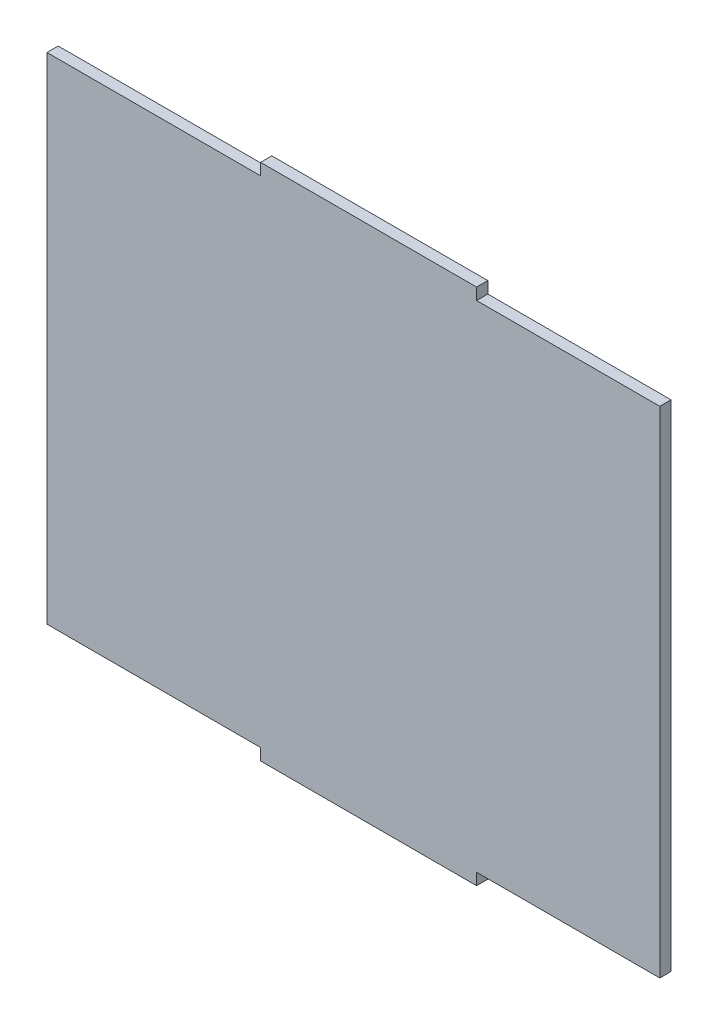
from build123d import *

# Parameters (mm, degrees)
SALIENTE_EXTRUIR1_DEPTH = 2.6


with BuildPart() as part:
    # Croquis1 → Saliente-Extruir1 (new body)
    with BuildSketch(Plane.XY):
        Polygon((60.877114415, 75.124350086), (78.83966909, 75.124350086), (93.369435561, 75.124350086), (103.27816412, 75.124350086), (103.27816412, -39.475649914), (93.398617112, -39.475649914), (78.83966909, -39.475649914), (60.877114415, -39.475649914), (60.877114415, -42.175649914), (10.877114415, -42.175649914), (10.877114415, -39.475649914), (-38.56033091, -39.475649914), (-38.56033091, 39.475649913), (-38.56033091, 75.124350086), (10.877114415, 75.124350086), (10.877114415, 77.824350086), (60.877114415, 77.824350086), align=None)
    extrude(amount=SALIENTE_EXTRUIR1_DEPTH)


solid = part.part
